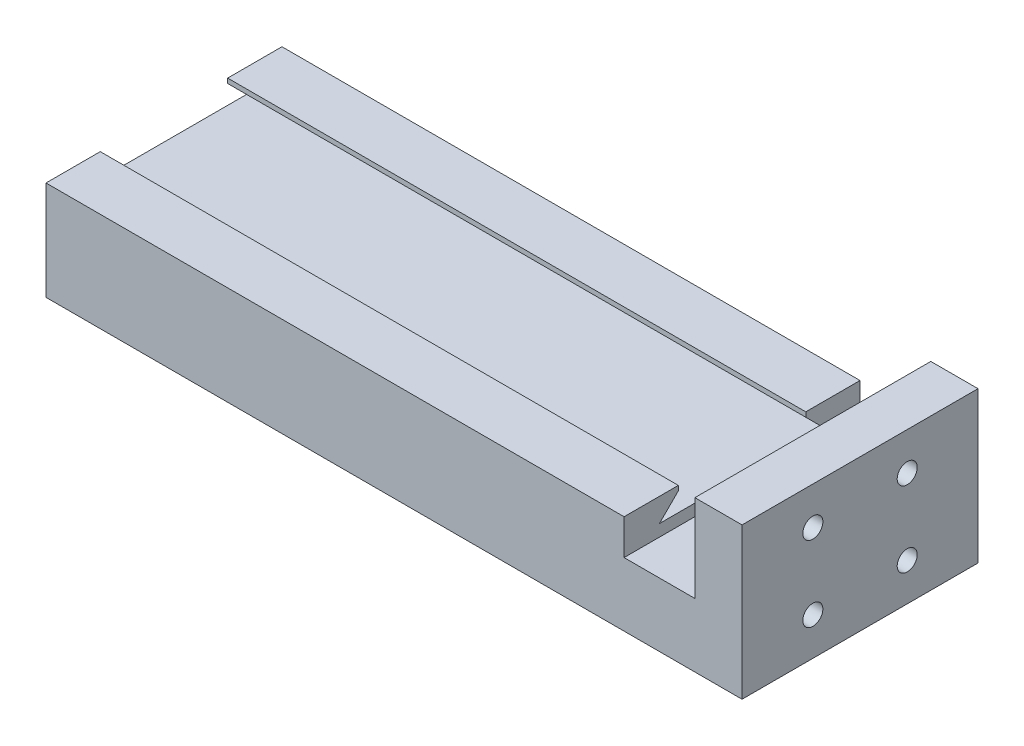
ISO-10303-21;
HEADER;
FILE_DESCRIPTION(('STEP AP214'),'2;1');
FILE_NAME('part.step','',(''),(''),'','','');
FILE_SCHEMA(('AUTOMOTIVE_DESIGN { 1 0 10303 214 1 1 1 1 }'));
ENDSEC;
DATA;
#1=APPLICATION_CONTEXT('core data for automotive mechanical design processes');
#2=APPLICATION_PROTOCOL_DEFINITION('international standard','automotive_design',2000,#1);
#3=PRODUCT_CONTEXT('',#1,'mechanical');
#4=PRODUCT('Part','Part','',(#3));
#5=PRODUCT_RELATED_PRODUCT_CATEGORY('part','',(#4));
#6=PRODUCT_DEFINITION_FORMATION('','',#4);
#7=PRODUCT_DEFINITION_CONTEXT('part definition',#1,'design');
#8=PRODUCT_DEFINITION('design','',#6,#7);
#9=PRODUCT_DEFINITION_SHAPE('','',#8);
#10=(LENGTH_UNIT() NAMED_UNIT(*) SI_UNIT(.MILLI.,.METRE.));
#11=(NAMED_UNIT(*) PLANE_ANGLE_UNIT() SI_UNIT($,.RADIAN.));
#12=(NAMED_UNIT(*) SI_UNIT($,.STERADIAN.) SOLID_ANGLE_UNIT());
#13=UNCERTAINTY_MEASURE_WITH_UNIT(LENGTH_MEASURE(1.E-05),#10,'distance_accuracy_value','');
#14=(GEOMETRIC_REPRESENTATION_CONTEXT(3) GLOBAL_UNCERTAINTY_ASSIGNED_CONTEXT((#13)) GLOBAL_UNIT_ASSIGNED_CONTEXT((#10,
#11,#12)) REPRESENTATION_CONTEXT('',''));
#15=CARTESIAN_POINT('',(0.,0.,0.));
#16=DIRECTION('',(0.,0.,1.));
#17=DIRECTION('',(1.,0.,0.));
#18=AXIS2_PLACEMENT_3D('',#15,#16,#17);
#19=CARTESIAN_POINT('',(97.5,42.,50.));
#20=DIRECTION('',(0.,-1.,0.));
#21=DIRECTION('',(1.,0.,0.));
#22=AXIS2_PLACEMENT_3D('',#19,#20,#21);
#23=PLANE('',#22);
#24=DIRECTION('',(0.,0.,-1.));
#25=VECTOR('',#24,1.);
#26=CARTESIAN_POINT('',(97.5,42.,50.));
#27=LINE('',#26,#25);
#28=CARTESIAN_POINT('',(97.5,42.,50.));
#29=VERTEX_POINT('',#28);
#30=CARTESIAN_POINT('',(97.5,42.,27.0000000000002));
#31=VERTEX_POINT('',#30);
#32=EDGE_CURVE('E140',#29,#31,#27,.T.);
#33=ORIENTED_EDGE('',*,*,#32,.T.);
#34=DIRECTION('',(-1.,0.,0.));
#35=VECTOR('',#34,1.);
#36=CARTESIAN_POINT('',(199.480390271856,42.,27.0000000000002));
#37=LINE('',#36,#35);
#38=CARTESIAN_POINT('',(-147.5,42.,27.0000000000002));
#39=VERTEX_POINT('',#38);
#40=EDGE_CURVE('E217',#31,#39,#37,.T.);
#41=ORIENTED_EDGE('',*,*,#40,.T.);
#42=DIRECTION('',(0.,0.,-1.));
#43=VECTOR('',#42,1.);
#44=CARTESIAN_POINT('',(-147.5,42.,50.));
#45=LINE('',#44,#43);
#46=CARTESIAN_POINT('',(-147.5,42.,50.));
#47=VERTEX_POINT('',#46);
#48=EDGE_CURVE('E167',#47,#39,#45,.T.);
#49=ORIENTED_EDGE('',*,*,#48,.F.);
#50=DIRECTION('',(-1.,0.,0.));
#51=VECTOR('',#50,1.);
#52=CARTESIAN_POINT('',(97.5,42.,50.));
#53=LINE('',#52,#51);
#54=EDGE_CURVE('E62',#29,#47,#53,.T.);
#55=ORIENTED_EDGE('',*,*,#54,.F.);
#56=EDGE_LOOP('',(#33,#41,#49,#55));
#57=FACE_BOUND('',#56,.T.);
#58=ADVANCED_FACE('F38',(#57),#23,.F.);
#59=CARTESIAN_POINT('',(-147.5,0.,50.));
#60=DIRECTION('',(1.,0.,0.));
#61=DIRECTION('',(0.,0.,-1.));
#62=AXIS2_PLACEMENT_3D('',#59,#60,#61);
#63=PLANE('',#62);
#64=ORIENTED_EDGE('',*,*,#48,.T.);
#65=DIRECTION('',(0.,1.,0.));
#66=VECTOR('',#65,1.);
#67=CARTESIAN_POINT('',(-147.5,42.,27.0000000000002));
#68=LINE('',#67,#66);
#69=CARTESIAN_POINT('',(-147.5,40.,27.0000000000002));
#70=VERTEX_POINT('',#69);
#71=EDGE_CURVE('E205',#70,#39,#68,.T.);
#72=ORIENTED_EDGE('',*,*,#71,.F.);
#73=DIRECTION('',(0.,0.707106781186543,-0.707106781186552));
#74=VECTOR('',#73,1.);
#75=CARTESIAN_POINT('',(-147.5,40.,27.0000000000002));
#76=LINE('',#75,#74);
#77=CARTESIAN_POINT('',(-147.5,32.,35.0000000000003));
#78=VERTEX_POINT('',#77);
#79=EDGE_CURVE('E222',#78,#70,#76,.T.);
#80=ORIENTED_EDGE('',*,*,#79,.F.);
#81=DIRECTION('',(0.,0.,1.));
#82=VECTOR('',#81,1.);
#83=CARTESIAN_POINT('',(-147.5,32.,-35.0000000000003));
#84=LINE('',#83,#82);
#85=CARTESIAN_POINT('',(-147.5,32.,-35.0000000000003));
#86=VERTEX_POINT('',#85);
#87=EDGE_CURVE('E225',#86,#78,#84,.T.);
#88=ORIENTED_EDGE('',*,*,#87,.F.);
#89=DIRECTION('',(0.,-0.707106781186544,-0.707106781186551));
#90=VECTOR('',#89,1.);
#91=CARTESIAN_POINT('',(-147.5,40.,-27.0000000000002));
#92=LINE('',#91,#90);
#93=CARTESIAN_POINT('',(-147.5,40.,-27.0000000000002));
#94=VERTEX_POINT('',#93);
#95=EDGE_CURVE('E228',#94,#86,#92,.T.);
#96=ORIENTED_EDGE('',*,*,#95,.F.);
#97=DIRECTION('',(0.,-1.,0.));
#98=VECTOR('',#97,1.);
#99=CARTESIAN_POINT('',(-147.5,42.,-27.0000000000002));
#100=LINE('',#99,#98);
#101=CARTESIAN_POINT('',(-147.5,42.,-27.0000000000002));
#102=VERTEX_POINT('',#101);
#103=EDGE_CURVE('E231',#102,#94,#100,.T.);
#104=ORIENTED_EDGE('',*,*,#103,.F.);
#105=CARTESIAN_POINT('',(-147.5,42.,-50.));
#106=VERTEX_POINT('',#105);
#107=EDGE_CURVE('E96',#102,#106,#45,.T.);
#108=ORIENTED_EDGE('',*,*,#107,.T.);
#109=DIRECTION('',(0.,-1.,0.));
#110=VECTOR('',#109,1.);
#111=CARTESIAN_POINT('',(-147.5,0.,-50.));
#112=LINE('',#111,#110);
#113=CARTESIAN_POINT('',(-147.5,0.,-50.));
#114=VERTEX_POINT('',#113);
#115=EDGE_CURVE('E150',#106,#114,#112,.T.);
#116=ORIENTED_EDGE('',*,*,#115,.T.);
#117=DIRECTION('',(0.,0.,-1.));
#118=VECTOR('',#117,1.);
#119=CARTESIAN_POINT('',(-147.5,0.,50.));
#120=LINE('',#119,#118);
#121=CARTESIAN_POINT('',(-147.5,0.,50.));
#122=VERTEX_POINT('',#121);
#123=EDGE_CURVE('E11',#122,#114,#120,.T.);
#124=ORIENTED_EDGE('',*,*,#123,.F.);
#125=DIRECTION('',(0.,-1.,0.));
#126=VECTOR('',#125,1.);
#127=CARTESIAN_POINT('',(-147.5,0.,50.));
#128=LINE('',#127,#126);
#129=EDGE_CURVE('E166',#47,#122,#128,.T.);
#130=ORIENTED_EDGE('',*,*,#129,.F.);
#131=EDGE_LOOP('',(#64,#72,#80,#88,#96,#104,#108,#116,#124,#130));
#132=FACE_BOUND('',#131,.T.);
#133=ADVANCED_FACE('F40',(#132),#63,.F.);
#134=CARTESIAN_POINT('',(-147.5,0.,50.));
#135=DIRECTION('',(0.,1.,0.));
#136=DIRECTION('',(0.,0.,1.));
#137=AXIS2_PLACEMENT_3D('',#134,#135,#136);
#138=PLANE('',#137);
#139=DIRECTION('',(1.,0.,0.));
#140=VECTOR('',#139,1.);
#141=CARTESIAN_POINT('',(-147.5,0.,-50.));
#142=LINE('',#141,#140);
#143=CARTESIAN_POINT('',(147.5,0.,-50.));
#144=VERTEX_POINT('',#143);
#145=EDGE_CURVE('E152',#114,#144,#142,.T.);
#146=ORIENTED_EDGE('',*,*,#145,.T.);
#147=DIRECTION('',(0.,0.,-1.));
#148=VECTOR('',#147,1.);
#149=CARTESIAN_POINT('',(147.5,0.,50.));
#150=LINE('',#149,#148);
#151=CARTESIAN_POINT('',(147.5,0.,50.));
#152=VERTEX_POINT('',#151);
#153=EDGE_CURVE('E46',#152,#144,#150,.T.);
#154=ORIENTED_EDGE('',*,*,#153,.F.);
#155=DIRECTION('',(1.,0.,0.));
#156=VECTOR('',#155,1.);
#157=CARTESIAN_POINT('',(-147.5,0.,50.));
#158=LINE('',#157,#156);
#159=EDGE_CURVE('E104',#122,#152,#158,.T.);
#160=ORIENTED_EDGE('',*,*,#159,.F.);
#161=ORIENTED_EDGE('',*,*,#123,.T.);
#162=EDGE_LOOP('',(#146,#154,#160,#161));
#163=FACE_BOUND('',#162,.T.);
#164=ADVANCED_FACE('F276',(#163),#138,.F.);
#165=CARTESIAN_POINT('',(147.5,0.,50.));
#166=DIRECTION('',(-1.,0.,0.));
#167=DIRECTION('',(0.,0.,1.));
#168=AXIS2_PLACEMENT_3D('',#165,#166,#167);
#169=PLANE('',#168);
#170=CARTESIAN_POINT('',(147.5,48.,20.));
#171=DIRECTION('',(1.,0.,0.));
#172=DIRECTION('',(0.,0.,-1.));
#173=AXIS2_PLACEMENT_3D('',#170,#171,#172);
#174=CIRCLE('',#173,4.25);
#175=CARTESIAN_POINT('',(147.5,48.,15.75));
#176=VERTEX_POINT('',#175);
#177=EDGE_CURVE('E267',#176,#176,#174,.T.);
#178=ORIENTED_EDGE('',*,*,#177,.F.);
#179=EDGE_LOOP('',(#178));
#180=FACE_BOUND('',#179,.T.);
#181=CARTESIAN_POINT('',(147.5,48.,-20.));
#182=DIRECTION('',(1.,0.,0.));
#183=DIRECTION('',(0.,0.,-1.));
#184=AXIS2_PLACEMENT_3D('',#181,#182,#183);
#185=CIRCLE('',#184,4.25);
#186=CARTESIAN_POINT('',(147.5,48.,-24.25));
#187=VERTEX_POINT('',#186);
#188=EDGE_CURVE('E261',#187,#187,#185,.T.);
#189=ORIENTED_EDGE('',*,*,#188,.F.);
#190=EDGE_LOOP('',(#189));
#191=FACE_BOUND('',#190,.T.);
#192=CARTESIAN_POINT('',(147.5,16.,-20.));
#193=DIRECTION('',(1.,0.,0.));
#194=DIRECTION('',(0.,0.,-1.));
#195=AXIS2_PLACEMENT_3D('',#192,#193,#194);
#196=CIRCLE('',#195,4.25);
#197=CARTESIAN_POINT('',(147.5,16.,-24.25));
#198=VERTEX_POINT('',#197);
#199=EDGE_CURVE('E255',#198,#198,#196,.T.);
#200=ORIENTED_EDGE('',*,*,#199,.F.);
#201=EDGE_LOOP('',(#200));
#202=FACE_BOUND('',#201,.T.);
#203=CARTESIAN_POINT('',(147.5,16.,20.));
#204=DIRECTION('',(1.,0.,0.));
#205=DIRECTION('',(0.,0.,-1.));
#206=AXIS2_PLACEMENT_3D('',#203,#204,#205);
#207=CIRCLE('',#206,4.25);
#208=CARTESIAN_POINT('',(147.5,16.,15.75));
#209=VERTEX_POINT('',#208);
#210=EDGE_CURVE('E249',#209,#209,#207,.T.);
#211=ORIENTED_EDGE('',*,*,#210,.F.);
#212=EDGE_LOOP('',(#211));
#213=FACE_BOUND('',#212,.T.);
#214=DIRECTION('',(0.,1.,0.));
#215=VECTOR('',#214,1.);
#216=CARTESIAN_POINT('',(147.5,0.,-50.));
#217=LINE('',#216,#215);
#218=CARTESIAN_POINT('',(147.5,64.,-50.));
#219=VERTEX_POINT('',#218);
#220=EDGE_CURVE('E155',#144,#219,#217,.T.);
#221=ORIENTED_EDGE('',*,*,#220,.T.);
#222=DIRECTION('',(0.,0.,-1.));
#223=VECTOR('',#222,1.);
#224=CARTESIAN_POINT('',(147.5,64.,50.));
#225=LINE('',#224,#223);
#226=CARTESIAN_POINT('',(147.5,64.,50.));
#227=VERTEX_POINT('',#226);
#228=EDGE_CURVE('E176',#227,#219,#225,.T.);
#229=ORIENTED_EDGE('',*,*,#228,.F.);
#230=DIRECTION('',(0.,1.,0.));
#231=VECTOR('',#230,1.);
#232=CARTESIAN_POINT('',(147.5,0.,50.));
#233=LINE('',#232,#231);
#234=EDGE_CURVE('E184',#152,#227,#233,.T.);
#235=ORIENTED_EDGE('',*,*,#234,.F.);
#236=ORIENTED_EDGE('',*,*,#153,.T.);
#237=EDGE_LOOP('',(#221,#229,#235,#236));
#238=FACE_BOUND('',#237,.T.);
#239=ADVANCED_FACE('F182',(#180,#191,#202,#213,#238),#169,.F.);
#240=CARTESIAN_POINT('',(147.5,64.,50.));
#241=DIRECTION('',(0.,-1.,0.));
#242=DIRECTION('',(0.,0.,-1.));
#243=AXIS2_PLACEMENT_3D('',#240,#241,#242);
#244=PLANE('',#243);
#245=DIRECTION('',(-1.,0.,0.));
#246=VECTOR('',#245,1.);
#247=CARTESIAN_POINT('',(147.5,64.,-50.));
#248=LINE('',#247,#246);
#249=CARTESIAN_POINT('',(127.5,64.,-50.));
#250=VERTEX_POINT('',#249);
#251=EDGE_CURVE('E157',#219,#250,#248,.T.);
#252=ORIENTED_EDGE('',*,*,#251,.T.);
#253=DIRECTION('',(0.,0.,-1.));
#254=VECTOR('',#253,1.);
#255=CARTESIAN_POINT('',(127.5,64.,50.));
#256=LINE('',#255,#254);
#257=CARTESIAN_POINT('',(127.5,64.,50.));
#258=VERTEX_POINT('',#257);
#259=EDGE_CURVE('E173',#258,#250,#256,.T.);
#260=ORIENTED_EDGE('',*,*,#259,.F.);
#261=DIRECTION('',(-1.,0.,0.));
#262=VECTOR('',#261,1.);
#263=CARTESIAN_POINT('',(147.5,64.,50.));
#264=LINE('',#263,#262);
#265=EDGE_CURVE('E196',#227,#258,#264,.T.);
#266=ORIENTED_EDGE('',*,*,#265,.F.);
#267=ORIENTED_EDGE('',*,*,#228,.T.);
#268=EDGE_LOOP('',(#252,#260,#266,#267));
#269=FACE_BOUND('',#268,.T.);
#270=ADVANCED_FACE('F192',(#269),#244,.F.);
#271=CARTESIAN_POINT('',(127.5,27.,50.));
#272=DIRECTION('',(1.,0.,0.));
#273=DIRECTION('',(0.,0.,-1.));
#274=AXIS2_PLACEMENT_3D('',#271,#272,#273);
#275=PLANE('',#274);
#276=CARTESIAN_POINT('',(127.5,48.,20.));
#277=DIRECTION('',(1.,0.,0.));
#278=DIRECTION('',(0.,0.,-1.));
#279=AXIS2_PLACEMENT_3D('',#276,#277,#278);
#280=CIRCLE('',#279,4.25);
#281=CARTESIAN_POINT('',(127.5,48.,15.75));
#282=VERTEX_POINT('',#281);
#283=EDGE_CURVE('E264',#282,#282,#280,.T.);
#284=ORIENTED_EDGE('',*,*,#283,.T.);
#285=EDGE_LOOP('',(#284));
#286=FACE_BOUND('',#285,.T.);
#287=CARTESIAN_POINT('',(127.5,48.,-20.));
#288=DIRECTION('',(1.,0.,0.));
#289=DIRECTION('',(0.,0.,-1.));
#290=AXIS2_PLACEMENT_3D('',#287,#288,#289);
#291=CIRCLE('',#290,4.25);
#292=CARTESIAN_POINT('',(127.5,48.,-24.25));
#293=VERTEX_POINT('',#292);
#294=EDGE_CURVE('E258',#293,#293,#291,.T.);
#295=ORIENTED_EDGE('',*,*,#294,.T.);
#296=EDGE_LOOP('',(#295));
#297=FACE_BOUND('',#296,.T.);
#298=DIRECTION('',(0.,-1.,0.));
#299=VECTOR('',#298,1.);
#300=CARTESIAN_POINT('',(127.5,27.,-50.));
#301=LINE('',#300,#299);
#302=CARTESIAN_POINT('',(127.5,27.,-50.));
#303=VERTEX_POINT('',#302);
#304=EDGE_CURVE('E159',#250,#303,#301,.T.);
#305=ORIENTED_EDGE('',*,*,#304,.T.);
#306=DIRECTION('',(0.,0.,-1.));
#307=VECTOR('',#306,1.);
#308=CARTESIAN_POINT('',(127.5,27.,50.));
#309=LINE('',#308,#307);
#310=CARTESIAN_POINT('',(127.5,27.,50.));
#311=VERTEX_POINT('',#310);
#312=EDGE_CURVE('E139',#311,#303,#309,.T.);
#313=ORIENTED_EDGE('',*,*,#312,.F.);
#314=DIRECTION('',(0.,-1.,0.));
#315=VECTOR('',#314,1.);
#316=CARTESIAN_POINT('',(127.5,27.,50.));
#317=LINE('',#316,#315);
#318=EDGE_CURVE('E126',#258,#311,#317,.T.);
#319=ORIENTED_EDGE('',*,*,#318,.F.);
#320=ORIENTED_EDGE('',*,*,#259,.T.);
#321=EDGE_LOOP('',(#305,#313,#319,#320));
#322=FACE_BOUND('',#321,.T.);
#323=ADVANCED_FACE('F195',(#286,#297,#322),#275,.F.);
#324=CARTESIAN_POINT('',(97.5,27.,50.));
#325=DIRECTION('',(0.,-1.,0.));
#326=DIRECTION('',(0.,0.,-1.));
#327=AXIS2_PLACEMENT_3D('',#324,#325,#326);
#328=PLANE('',#327);
#329=DIRECTION('',(-1.,0.,0.));
#330=VECTOR('',#329,1.);
#331=CARTESIAN_POINT('',(97.5,27.,-50.));
#332=LINE('',#331,#330);
#333=CARTESIAN_POINT('',(97.5,27.,-50.));
#334=VERTEX_POINT('',#333);
#335=EDGE_CURVE('E135',#303,#334,#332,.T.);
#336=ORIENTED_EDGE('',*,*,#335,.T.);
#337=DIRECTION('',(0.,0.,-1.));
#338=VECTOR('',#337,1.);
#339=CARTESIAN_POINT('',(97.5,27.,50.));
#340=LINE('',#339,#338);
#341=CARTESIAN_POINT('',(97.5,27.,50.));
#342=VERTEX_POINT('',#341);
#343=EDGE_CURVE('E132',#342,#334,#340,.T.);
#344=ORIENTED_EDGE('',*,*,#343,.F.);
#345=DIRECTION('',(-1.,0.,0.));
#346=VECTOR('',#345,1.);
#347=CARTESIAN_POINT('',(97.5,27.,50.));
#348=LINE('',#347,#346);
#349=EDGE_CURVE('E119',#311,#342,#348,.T.);
#350=ORIENTED_EDGE('',*,*,#349,.F.);
#351=ORIENTED_EDGE('',*,*,#312,.T.);
#352=EDGE_LOOP('',(#336,#344,#350,#351));
#353=FACE_BOUND('',#352,.T.);
#354=ADVANCED_FACE('F133',(#353),#328,.F.);
#355=CARTESIAN_POINT('',(97.5,42.,50.));
#356=DIRECTION('',(-1.,0.,0.));
#357=DIRECTION('',(0.,0.,1.));
#358=AXIS2_PLACEMENT_3D('',#355,#356,#357);
#359=PLANE('',#358);
#360=DIRECTION('',(0.,-0.707106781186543,0.707106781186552));
#361=VECTOR('',#360,1.);
#362=CARTESIAN_POINT('',(97.5,40.,27.0000000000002));
#363=LINE('',#362,#361);
#364=CARTESIAN_POINT('',(97.5,40.,27.0000000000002));
#365=VERTEX_POINT('',#364);
#366=CARTESIAN_POINT('',(97.5,32.,35.0000000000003));
#367=VERTEX_POINT('',#366);
#368=EDGE_CURVE('E237',#365,#367,#363,.T.);
#369=ORIENTED_EDGE('',*,*,#368,.F.);
#370=DIRECTION('',(0.,-1.,0.));
#371=VECTOR('',#370,1.);
#372=CARTESIAN_POINT('',(97.5,42.,27.0000000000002));
#373=LINE('',#372,#371);
#374=EDGE_CURVE('E153',#31,#365,#373,.T.);
#375=ORIENTED_EDGE('',*,*,#374,.F.);
#376=ORIENTED_EDGE('',*,*,#32,.F.);
#377=DIRECTION('',(0.,1.,0.));
#378=VECTOR('',#377,1.);
#379=CARTESIAN_POINT('',(97.5,42.,50.));
#380=LINE('',#379,#378);
#381=EDGE_CURVE('E123',#342,#29,#380,.T.);
#382=ORIENTED_EDGE('',*,*,#381,.F.);
#383=ORIENTED_EDGE('',*,*,#343,.T.);
#384=DIRECTION('',(0.,1.,0.));
#385=VECTOR('',#384,1.);
#386=CARTESIAN_POINT('',(97.5,42.,-50.));
#387=LINE('',#386,#385);
#388=CARTESIAN_POINT('',(97.5,42.,-50.));
#389=VERTEX_POINT('',#388);
#390=EDGE_CURVE('E162',#334,#389,#387,.T.);
#391=ORIENTED_EDGE('',*,*,#390,.T.);
#392=CARTESIAN_POINT('',(97.5,42.,-27.0000000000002));
#393=VERTEX_POINT('',#392);
#394=EDGE_CURVE('E170',#393,#389,#27,.T.);
#395=ORIENTED_EDGE('',*,*,#394,.F.);
#396=DIRECTION('',(0.,1.,0.));
#397=VECTOR('',#396,1.);
#398=CARTESIAN_POINT('',(97.5,42.,-27.0000000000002));
#399=LINE('',#398,#397);
#400=CARTESIAN_POINT('',(97.5,40.,-27.0000000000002));
#401=VERTEX_POINT('',#400);
#402=EDGE_CURVE('E53',#401,#393,#399,.T.);
#403=ORIENTED_EDGE('',*,*,#402,.F.);
#404=DIRECTION('',(0.,0.707106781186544,0.707106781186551));
#405=VECTOR('',#404,1.);
#406=CARTESIAN_POINT('',(97.5,40.,-27.0000000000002));
#407=LINE('',#406,#405);
#408=CARTESIAN_POINT('',(97.5,32.,-35.0000000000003));
#409=VERTEX_POINT('',#408);
#410=EDGE_CURVE('E243',#409,#401,#407,.T.);
#411=ORIENTED_EDGE('',*,*,#410,.F.);
#412=DIRECTION('',(0.,0.,-1.));
#413=VECTOR('',#412,1.);
#414=CARTESIAN_POINT('',(97.5,32.,-35.0000000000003));
#415=LINE('',#414,#413);
#416=EDGE_CURVE('E240',#367,#409,#415,.T.);
#417=ORIENTED_EDGE('',*,*,#416,.F.);
#418=EDGE_LOOP('',(#369,#375,#376,#382,#383,#391,#395,#403,#411,#417));
#419=FACE_BOUND('',#418,.T.);
#420=ADVANCED_FACE('F143',(#419),#359,.F.);
#421=ORIENTED_EDGE('',*,*,#107,.F.);
#422=DIRECTION('',(-1.,0.,0.));
#423=VECTOR('',#422,1.);
#424=CARTESIAN_POINT('',(199.480390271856,42.,-27.0000000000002));
#425=LINE('',#424,#423);
#426=EDGE_CURVE('E202',#393,#102,#425,.T.);
#427=ORIENTED_EDGE('',*,*,#426,.F.);
#428=ORIENTED_EDGE('',*,*,#394,.T.);
#429=DIRECTION('',(-1.,0.,0.));
#430=VECTOR('',#429,1.);
#431=CARTESIAN_POINT('',(97.5,42.,-50.));
#432=LINE('',#431,#430);
#433=EDGE_CURVE('E164',#389,#106,#432,.T.);
#434=ORIENTED_EDGE('',*,*,#433,.T.);
#435=EDGE_LOOP('',(#421,#427,#428,#434));
#436=FACE_BOUND('',#435,.T.);
#437=ADVANCED_FACE('F304',(#436),#23,.F.);
#438=CARTESIAN_POINT('',(0.,0.,50.));
#439=DIRECTION('',(0.,0.,1.));
#440=DIRECTION('',(1.,0.,0.));
#441=AXIS2_PLACEMENT_3D('',#438,#439,#440);
#442=PLANE('',#441);
#443=ORIENTED_EDGE('',*,*,#129,.T.);
#444=ORIENTED_EDGE('',*,*,#159,.T.);
#445=ORIENTED_EDGE('',*,*,#234,.T.);
#446=ORIENTED_EDGE('',*,*,#265,.T.);
#447=ORIENTED_EDGE('',*,*,#318,.T.);
#448=ORIENTED_EDGE('',*,*,#349,.T.);
#449=ORIENTED_EDGE('',*,*,#381,.T.);
#450=ORIENTED_EDGE('',*,*,#54,.T.);
#451=EDGE_LOOP('',(#443,#444,#445,#446,#447,#448,#449,#450));
#452=FACE_BOUND('',#451,.T.);
#453=ADVANCED_FACE('F121',(#452),#442,.T.);
#454=CARTESIAN_POINT('',(0.,0.,-50.));
#455=DIRECTION('',(0.,0.,1.));
#456=DIRECTION('',(1.,0.,0.));
#457=AXIS2_PLACEMENT_3D('',#454,#455,#456);
#458=PLANE('',#457);
#459=ORIENTED_EDGE('',*,*,#115,.F.);
#460=ORIENTED_EDGE('',*,*,#433,.F.);
#461=ORIENTED_EDGE('',*,*,#390,.F.);
#462=ORIENTED_EDGE('',*,*,#335,.F.);
#463=ORIENTED_EDGE('',*,*,#304,.F.);
#464=ORIENTED_EDGE('',*,*,#251,.F.);
#465=ORIENTED_EDGE('',*,*,#220,.F.);
#466=ORIENTED_EDGE('',*,*,#145,.F.);
#467=EDGE_LOOP('',(#459,#460,#461,#462,#463,#464,#465,#466));
#468=FACE_BOUND('',#467,.T.);
#469=ADVANCED_FACE('F188',(#468),#458,.F.);
#470=CARTESIAN_POINT('',(199.480390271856,42.,27.0000000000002));
#471=DIRECTION('',(0.,0.,1.));
#472=DIRECTION('',(0.,-1.,0.));
#473=AXIS2_PLACEMENT_3D('',#470,#471,#472);
#474=PLANE('',#473);
#475=ORIENTED_EDGE('',*,*,#374,.T.);
#476=DIRECTION('',(-1.,0.,0.));
#477=VECTOR('',#476,1.);
#478=CARTESIAN_POINT('',(199.480390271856,40.,27.0000000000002));
#479=LINE('',#478,#477);
#480=EDGE_CURVE('E214',#365,#70,#479,.T.);
#481=ORIENTED_EDGE('',*,*,#480,.T.);
#482=ORIENTED_EDGE('',*,*,#71,.T.);
#483=ORIENTED_EDGE('',*,*,#40,.F.);
#484=EDGE_LOOP('',(#475,#481,#482,#483));
#485=FACE_BOUND('',#484,.T.);
#486=ADVANCED_FACE('F387',(#485),#474,.F.);
#487=CARTESIAN_POINT('',(199.480390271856,40.,27.0000000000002));
#488=DIRECTION('',(0.,0.707106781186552,0.707106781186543));
#489=DIRECTION('',(0.,-0.707106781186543,0.707106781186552));
#490=AXIS2_PLACEMENT_3D('',#487,#488,#489);
#491=PLANE('',#490);
#492=ORIENTED_EDGE('',*,*,#368,.T.);
#493=DIRECTION('',(-1.,0.,0.));
#494=VECTOR('',#493,1.);
#495=CARTESIAN_POINT('',(199.480390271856,32.,35.0000000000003));
#496=LINE('',#495,#494);
#497=EDGE_CURVE('E211',#367,#78,#496,.T.);
#498=ORIENTED_EDGE('',*,*,#497,.T.);
#499=ORIENTED_EDGE('',*,*,#79,.T.);
#500=ORIENTED_EDGE('',*,*,#480,.F.);
#501=EDGE_LOOP('',(#492,#498,#499,#500));
#502=FACE_BOUND('',#501,.T.);
#503=ADVANCED_FACE('F392',(#502),#491,.F.);
#504=CARTESIAN_POINT('',(199.480390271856,32.,-35.0000000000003));
#505=DIRECTION('',(0.,-1.,0.));
#506=DIRECTION('',(0.,0.,-1.));
#507=AXIS2_PLACEMENT_3D('',#504,#505,#506);
#508=PLANE('',#507);
#509=ORIENTED_EDGE('',*,*,#416,.T.);
#510=DIRECTION('',(-1.,0.,0.));
#511=VECTOR('',#510,1.);
#512=CARTESIAN_POINT('',(199.480390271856,32.,-35.0000000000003));
#513=LINE('',#512,#511);
#514=EDGE_CURVE('E208',#409,#86,#513,.T.);
#515=ORIENTED_EDGE('',*,*,#514,.T.);
#516=ORIENTED_EDGE('',*,*,#87,.T.);
#517=ORIENTED_EDGE('',*,*,#497,.F.);
#518=EDGE_LOOP('',(#509,#515,#516,#517));
#519=FACE_BOUND('',#518,.T.);
#520=ADVANCED_FACE('F404',(#519),#508,.F.);
#521=CARTESIAN_POINT('',(199.480390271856,40.,-27.0000000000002));
#522=DIRECTION('',(0.,0.707106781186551,-0.707106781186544));
#523=DIRECTION('',(0.,0.707106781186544,0.707106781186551));
#524=AXIS2_PLACEMENT_3D('',#521,#522,#523);
#525=PLANE('',#524);
#526=ORIENTED_EDGE('',*,*,#410,.T.);
#527=DIRECTION('',(-1.,0.,0.));
#528=VECTOR('',#527,1.);
#529=CARTESIAN_POINT('',(199.480390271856,40.,-27.0000000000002));
#530=LINE('',#529,#528);
#531=EDGE_CURVE('E204',#401,#94,#530,.T.);
#532=ORIENTED_EDGE('',*,*,#531,.T.);
#533=ORIENTED_EDGE('',*,*,#95,.T.);
#534=ORIENTED_EDGE('',*,*,#514,.F.);
#535=EDGE_LOOP('',(#526,#532,#533,#534));
#536=FACE_BOUND('',#535,.T.);
#537=ADVANCED_FACE('F350',(#536),#525,.F.);
#538=CARTESIAN_POINT('',(199.480390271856,42.,-27.0000000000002));
#539=DIRECTION('',(0.,0.,-1.));
#540=DIRECTION('',(-1.,0.,0.));
#541=AXIS2_PLACEMENT_3D('',#538,#539,#540);
#542=PLANE('',#541);
#543=ORIENTED_EDGE('',*,*,#402,.T.);
#544=ORIENTED_EDGE('',*,*,#426,.T.);
#545=ORIENTED_EDGE('',*,*,#103,.T.);
#546=ORIENTED_EDGE('',*,*,#531,.F.);
#547=EDGE_LOOP('',(#543,#544,#545,#546));
#548=FACE_BOUND('',#547,.T.);
#549=ADVANCED_FACE('F297',(#548),#542,.F.);
#550=CARTESIAN_POINT('',(123.,16.,20.));
#551=DIRECTION('',(1.,0.,0.));
#552=DIRECTION('',(0.,0.,-1.));
#553=AXIS2_PLACEMENT_3D('',#550,#551,#552);
#554=CONICAL_SURFACE('',#553,4.25,1.02974425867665);
#555=CARTESIAN_POINT('',(120.446342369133,16.,20.));
#556=VERTEX_POINT('',#555);
#557=VERTEX_LOOP('',#556);
#558=FACE_BOUND('',#557,.T.);
#559=CARTESIAN_POINT('',(123.,16.,20.));
#560=DIRECTION('',(1.,0.,0.));
#561=DIRECTION('',(0.,0.,-1.));
#562=AXIS2_PLACEMENT_3D('',#559,#560,#561);
#563=CIRCLE('',#562,4.25);
#564=CARTESIAN_POINT('',(123.,16.,15.75));
#565=VERTEX_POINT('',#564);
#566=EDGE_CURVE('E234',#565,#565,#563,.T.);
#567=ORIENTED_EDGE('',*,*,#566,.T.);
#568=EDGE_LOOP('',(#567));
#569=FACE_BOUND('',#568,.T.);
#570=ADVANCED_FACE('F287',(#558,#569),#554,.F.);
#571=CARTESIAN_POINT('',(147.5,16.,20.));
#572=DIRECTION('',(1.,0.,0.));
#573=DIRECTION('',(0.,0.,-1.));
#574=AXIS2_PLACEMENT_3D('',#571,#572,#573);
#575=CYLINDRICAL_SURFACE('',#574,4.25);
#576=ORIENTED_EDGE('',*,*,#566,.F.);
#577=EDGE_LOOP('',(#576));
#578=FACE_BOUND('',#577,.T.);
#579=ORIENTED_EDGE('',*,*,#210,.T.);
#580=EDGE_LOOP('',(#579));
#581=FACE_BOUND('',#580,.T.);
#582=ADVANCED_FACE('F284',(#578,#581),#575,.F.);
#583=CARTESIAN_POINT('',(123.,16.,-20.));
#584=DIRECTION('',(1.,0.,0.));
#585=DIRECTION('',(0.,0.,-1.));
#586=AXIS2_PLACEMENT_3D('',#583,#584,#585);
#587=CONICAL_SURFACE('',#586,4.25,1.02974425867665);
#588=CARTESIAN_POINT('',(120.446342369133,16.,-20.));
#589=VERTEX_POINT('',#588);
#590=VERTEX_LOOP('',#589);
#591=FACE_BOUND('',#590,.T.);
#592=CARTESIAN_POINT('',(123.,16.,-20.));
#593=DIRECTION('',(1.,0.,0.));
#594=DIRECTION('',(0.,0.,-1.));
#595=AXIS2_PLACEMENT_3D('',#592,#593,#594);
#596=CIRCLE('',#595,4.25);
#597=CARTESIAN_POINT('',(123.,16.,-24.25));
#598=VERTEX_POINT('',#597);
#599=EDGE_CURVE('E252',#598,#598,#596,.T.);
#600=ORIENTED_EDGE('',*,*,#599,.T.);
#601=EDGE_LOOP('',(#600));
#602=FACE_BOUND('',#601,.T.);
#603=ADVANCED_FACE('F286',(#591,#602),#587,.F.);
#604=CARTESIAN_POINT('',(147.5,16.,-20.));
#605=DIRECTION('',(1.,0.,0.));
#606=DIRECTION('',(0.,0.,-1.));
#607=AXIS2_PLACEMENT_3D('',#604,#605,#606);
#608=CYLINDRICAL_SURFACE('',#607,4.25);
#609=ORIENTED_EDGE('',*,*,#599,.F.);
#610=EDGE_LOOP('',(#609));
#611=FACE_BOUND('',#610,.T.);
#612=ORIENTED_EDGE('',*,*,#199,.T.);
#613=EDGE_LOOP('',(#612));
#614=FACE_BOUND('',#613,.T.);
#615=ADVANCED_FACE('F294',(#611,#614),#608,.F.);
#616=CARTESIAN_POINT('',(147.5,48.,-20.));
#617=DIRECTION('',(1.,0.,0.));
#618=DIRECTION('',(0.,0.,-1.));
#619=AXIS2_PLACEMENT_3D('',#616,#617,#618);
#620=CYLINDRICAL_SURFACE('',#619,4.25);
#621=ORIENTED_EDGE('',*,*,#188,.T.);
#622=EDGE_LOOP('',(#621));
#623=FACE_BOUND('',#622,.T.);
#624=ORIENTED_EDGE('',*,*,#294,.F.);
#625=EDGE_LOOP('',(#624));
#626=FACE_BOUND('',#625,.T.);
#627=ADVANCED_FACE('F470',(#623,#626),#620,.F.);
#628=CARTESIAN_POINT('',(147.5,48.,20.));
#629=DIRECTION('',(1.,0.,0.));
#630=DIRECTION('',(0.,0.,-1.));
#631=AXIS2_PLACEMENT_3D('',#628,#629,#630);
#632=CYLINDRICAL_SURFACE('',#631,4.25);
#633=ORIENTED_EDGE('',*,*,#177,.T.);
#634=EDGE_LOOP('',(#633));
#635=FACE_BOUND('',#634,.T.);
#636=ORIENTED_EDGE('',*,*,#283,.F.);
#637=EDGE_LOOP('',(#636));
#638=FACE_BOUND('',#637,.T.);
#639=ADVANCED_FACE('F271',(#635,#638),#632,.F.);
#640=CLOSED_SHELL('',(#58,#133,#164,#239,#270,#323,#354,#420,#437,#453,#469,#486,#503,#520,#537,
#549,#570,#582,#603,#615,#627,#639));
#641=MANIFOLD_SOLID_BREP('B2',#640);
#642=ADVANCED_BREP_SHAPE_REPRESENTATION('',(#18,#641),#14);
#643=SHAPE_DEFINITION_REPRESENTATION(#9,#642);
ENDSEC;
END-ISO-10303-21;
